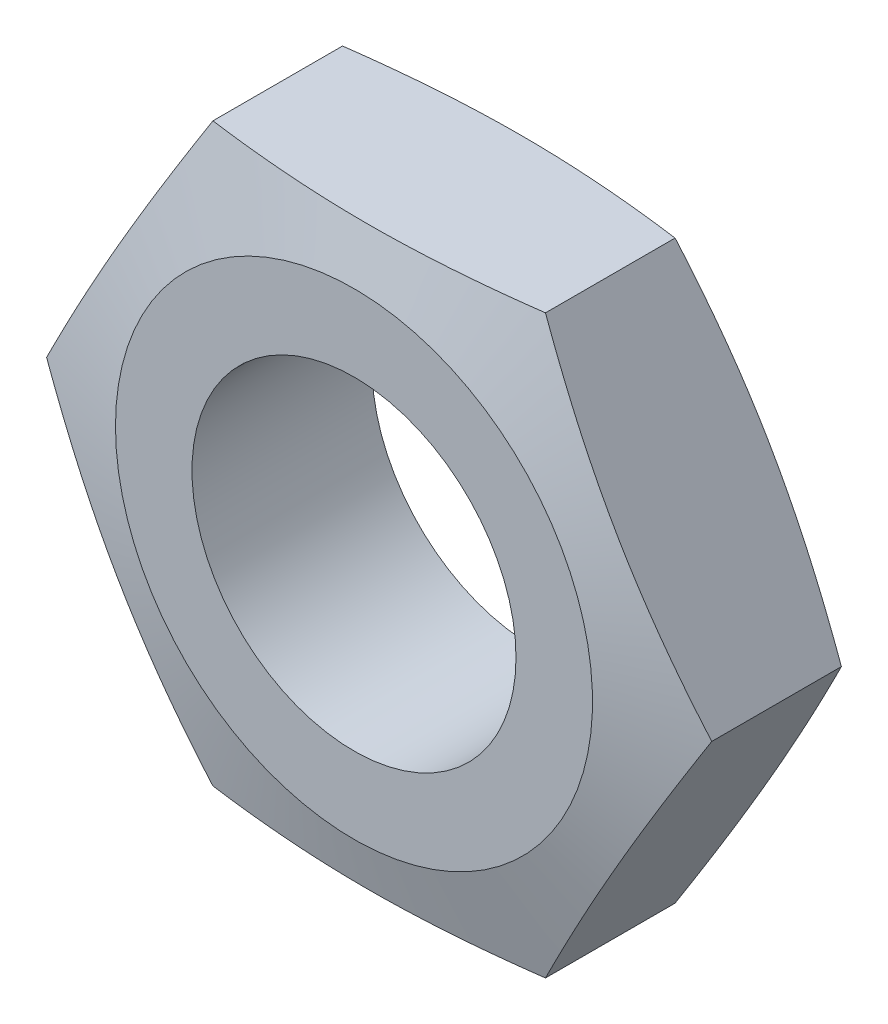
ISO-10303-21;
HEADER;
FILE_DESCRIPTION(('STEP AP214'),'2;1');
FILE_NAME('part.step','',(''),(''),'','','');
FILE_SCHEMA(('AUTOMOTIVE_DESIGN { 1 0 10303 214 1 1 1 1 }'));
ENDSEC;
DATA;
#1=APPLICATION_CONTEXT('core data for automotive mechanical design processes');
#2=APPLICATION_PROTOCOL_DEFINITION('international standard','automotive_design',2000,#1);
#3=PRODUCT_CONTEXT('',#1,'mechanical');
#4=PRODUCT('Part','Part','',(#3));
#5=PRODUCT_RELATED_PRODUCT_CATEGORY('part','',(#4));
#6=PRODUCT_DEFINITION_FORMATION('','',#4);
#7=PRODUCT_DEFINITION_CONTEXT('part definition',#1,'design');
#8=PRODUCT_DEFINITION('design','',#6,#7);
#9=PRODUCT_DEFINITION_SHAPE('','',#8);
#10=(LENGTH_UNIT() NAMED_UNIT(*) SI_UNIT(.MILLI.,.METRE.));
#11=(NAMED_UNIT(*) PLANE_ANGLE_UNIT() SI_UNIT($,.RADIAN.));
#12=(NAMED_UNIT(*) SI_UNIT($,.STERADIAN.) SOLID_ANGLE_UNIT());
#13=UNCERTAINTY_MEASURE_WITH_UNIT(LENGTH_MEASURE(1.E-05),#10,'distance_accuracy_value','');
#14=(GEOMETRIC_REPRESENTATION_CONTEXT(3) GLOBAL_UNCERTAINTY_ASSIGNED_CONTEXT((#13)) GLOBAL_UNIT_ASSIGNED_CONTEXT((#10,
#11,#12)) REPRESENTATION_CONTEXT('',''));
#15=CARTESIAN_POINT('',(0.,0.,0.));
#16=DIRECTION('',(0.,0.,1.));
#17=DIRECTION('',(1.,0.,0.));
#18=AXIS2_PLACEMENT_3D('',#15,#16,#17);
#19=CARTESIAN_POINT('',(-9.23760430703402,0.,-2.5));
#20=DIRECTION('',(0.866025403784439,-0.5,0.));
#21=DIRECTION('',(0.5,0.866025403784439,0.));
#22=AXIS2_PLACEMENT_3D('',#19,#20,#21);
#23=PLANE('',#22);
#24=CARTESIAN_POINT('',(-4.61868668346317,8.0002,1.79996905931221));
#25=CARTESIAN_POINT('',(-4.81050350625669,7.66796351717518,1.85138759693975));
#26=CARTESIAN_POINT('',(-5.0026681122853,7.33512465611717,1.89806712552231));
#27=CARTESIAN_POINT('',(-5.38767596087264,6.66827150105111,1.98007865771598));
#28=CARTESIAN_POINT('',(-5.58051944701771,6.33425678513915,2.01540605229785));
#29=CARTESIAN_POINT('',(-5.96571585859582,5.66707702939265,2.07265094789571));
#30=CARTESIAN_POINT('',(-6.15806617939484,5.33391650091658,2.09463671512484));
#31=CARTESIAN_POINT('',(-6.54301211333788,4.66717058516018,2.12411737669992));
#32=CARTESIAN_POINT('',(-6.7356076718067,4.33358529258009,2.13161507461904));
#33=CARTESIAN_POINT('',(-7.12079878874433,3.66641470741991,2.13161507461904));
#34=CARTESIAN_POINT('',(-7.31339434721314,3.33282941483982,2.12411737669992));
#35=CARTESIAN_POINT('',(-7.69834028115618,2.66608349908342,2.09463671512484));
#36=CARTESIAN_POINT('',(-7.8906906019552,2.33292297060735,2.07265094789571));
#37=CARTESIAN_POINT('',(-8.27588701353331,1.66574321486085,2.01540605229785));
#38=CARTESIAN_POINT('',(-8.46873049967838,1.33172849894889,1.98007865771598));
#39=CARTESIAN_POINT('',(-8.85373834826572,0.664875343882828,1.89806712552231));
#40=CARTESIAN_POINT('',(-9.04590295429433,0.332036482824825,1.85138759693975));
#41=CARTESIAN_POINT('',(-9.23771977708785,-0.000199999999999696,1.79996905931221));
#42=B_SPLINE_CURVE_WITH_KNOTS('',3,(#24,#25,#26,#27,#28,#29,#30,#31,#32,#33,#34,#35,#36,#37,#38,
#39,#40,#41),.UNSPECIFIED.,.F.,.F.,(4,2,2,2,2,2,2,2,4),(0.,1.1612532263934,2.32297733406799,
3.47870589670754,4.63421079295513,5.78971568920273,6.94544425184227,8.10716835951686,
9.26842158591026),.UNSPECIFIED.);
#43=CARTESIAN_POINT('',(-4.61880215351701,8.,1.8));
#44=VERTEX_POINT('',#43);
#45=CARTESIAN_POINT('',(-9.23760430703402,0.,1.8));
#46=VERTEX_POINT('',#45);
#47=EDGE_CURVE('E43',#44,#46,#42,.T.);
#48=ORIENTED_EDGE('',*,*,#47,.F.);
#49=DIRECTION('',(0.,0.,1.));
#50=VECTOR('',#49,1.);
#51=CARTESIAN_POINT('',(-4.61880215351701,8.,-2.5));
#52=LINE('',#51,#50);
#53=CARTESIAN_POINT('',(-4.61880215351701,8.,-1.8));
#54=VERTEX_POINT('',#53);
#55=EDGE_CURVE('E11',#54,#44,#52,.T.);
#56=ORIENTED_EDGE('',*,*,#55,.F.);
#57=CARTESIAN_POINT('',(-9.23771977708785,-0.000199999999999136,-1.79996905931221));
#58=CARTESIAN_POINT('',(-9.04590295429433,0.332036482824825,-1.85138759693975));
#59=CARTESIAN_POINT('',(-8.85373834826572,0.664875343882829,-1.89806712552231));
#60=CARTESIAN_POINT('',(-8.46873049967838,1.33172849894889,-1.98007865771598));
#61=CARTESIAN_POINT('',(-8.27588701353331,1.66574321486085,-2.01540605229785));
#62=CARTESIAN_POINT('',(-7.8906906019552,2.33292297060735,-2.07265094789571));
#63=CARTESIAN_POINT('',(-7.69834028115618,2.66608349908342,-2.09463671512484));
#64=CARTESIAN_POINT('',(-7.31339434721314,3.33282941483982,-2.12411737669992));
#65=CARTESIAN_POINT('',(-7.12079878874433,3.66641470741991,-2.13161507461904));
#66=CARTESIAN_POINT('',(-6.7356076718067,4.33358529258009,-2.13161507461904));
#67=CARTESIAN_POINT('',(-6.54301211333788,4.66717058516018,-2.12411737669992));
#68=CARTESIAN_POINT('',(-6.15806617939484,5.33391650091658,-2.09463671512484));
#69=CARTESIAN_POINT('',(-5.96571585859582,5.66707702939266,-2.07265094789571));
#70=CARTESIAN_POINT('',(-5.58051944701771,6.33425678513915,-2.01540605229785));
#71=CARTESIAN_POINT('',(-5.38767596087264,6.66827150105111,-1.98007865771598));
#72=CARTESIAN_POINT('',(-5.0026681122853,7.33512465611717,-1.89806712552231));
#73=CARTESIAN_POINT('',(-4.81050350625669,7.66796351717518,-1.85138759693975));
#74=CARTESIAN_POINT('',(-4.61868668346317,8.0002,-1.79996905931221));
#75=B_SPLINE_CURVE_WITH_KNOTS('',3,(#57,#58,#59,#60,#61,#62,#63,#64,#65,#66,#67,#68,#69,#70,#71,
#72,#73,#74),.UNSPECIFIED.,.F.,.F.,(4,2,2,2,2,2,2,2,4),(0.,1.1612532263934,2.32297733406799,
3.47870589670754,4.63421079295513,5.78971568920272,6.94544425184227,8.10716835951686,
9.26842158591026),.UNSPECIFIED.);
#76=CARTESIAN_POINT('',(-9.23760430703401,0.,-1.8));
#77=VERTEX_POINT('',#76);
#78=EDGE_CURVE('E99',#77,#54,#75,.T.);
#79=ORIENTED_EDGE('',*,*,#78,.F.);
#80=DIRECTION('',(0.,0.,1.));
#81=VECTOR('',#80,1.);
#82=CARTESIAN_POINT('',(-9.23760430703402,0.,-2.5));
#83=LINE('',#82,#81);
#84=EDGE_CURVE('E92',#77,#46,#83,.T.);
#85=ORIENTED_EDGE('',*,*,#84,.T.);
#86=EDGE_LOOP('',(#48,#56,#79,#85));
#87=FACE_BOUND('',#86,.T.);
#88=ADVANCED_FACE('F28',(#87),#23,.F.);
#89=CARTESIAN_POINT('',(-4.61880215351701,8.,-2.5));
#90=DIRECTION('',(0.,-1.,0.));
#91=DIRECTION('',(1.,0.,0.));
#92=AXIS2_PLACEMENT_3D('',#89,#90,#91);
#93=PLANE('',#92);
#94=CARTESIAN_POINT('',(-12.1849225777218,8.,0.369465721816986));
#95=CARTESIAN_POINT('',(-11.8223547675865,8.,0.450654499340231));
#96=CARTESIAN_POINT('',(-11.4595592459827,8.,0.53084468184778));
#97=CARTESIAN_POINT('',(-10.7334010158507,8.,0.688688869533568));
#98=CARTESIAN_POINT('',(-10.3700382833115,8.,0.766342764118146));
#99=CARTESIAN_POINT('',(-9.64230414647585,8.,0.918643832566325));
#100=CARTESIAN_POINT('',(-9.27793209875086,8.,0.993287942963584));
#101=CARTESIAN_POINT('',(-8.54842712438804,8.,1.13875840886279));
#102=CARTESIAN_POINT('',(-8.1832942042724,8.,1.20958479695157));
#103=CARTESIAN_POINT('',(-7.45507803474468,8.,1.34595992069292));
#104=CARTESIAN_POINT('',(-7.09200190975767,8.,1.41154651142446));
#105=CARTESIAN_POINT('',(-6.36485746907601,8.,1.53695681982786));
#106=CARTESIAN_POINT('',(-6.00078917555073,8.,1.59678066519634));
#107=CARTESIAN_POINT('',(-5.27159334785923,8.,1.70931153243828));
#108=CARTESIAN_POINT('',(-4.90646595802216,8.,1.76201948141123));
#109=CARTESIAN_POINT('',(-4.17505043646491,8.,1.85875926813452));
#110=CARTESIAN_POINT('',(-3.80876230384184,8.,1.90279109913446));
#111=CARTESIAN_POINT('',(-3.07090406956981,8.,1.98092498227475));
#112=CARTESIAN_POINT('',(-2.69932123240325,8.,2.01490855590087));
#113=CARTESIAN_POINT('',(-1.95522869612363,8.,2.07059677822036));
#114=CARTESIAN_POINT('',(-1.58271901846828,8.,2.0923017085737));
#115=CARTESIAN_POINT('',(-0.83731293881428,8.,2.12216640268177));
#116=CARTESIAN_POINT('',(-0.464416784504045,8.,2.13033222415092));
#117=CARTESIAN_POINT('',(0.28141928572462,8.,2.13261752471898));
#118=CARTESIAN_POINT('',(0.654359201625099,8.,2.12673700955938));
#119=CARTESIAN_POINT('',(1.40113374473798,8.,2.10125984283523));
#120=CARTESIAN_POINT('',(1.77496661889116,8.,2.08161283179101));
#121=CARTESIAN_POINT('',(2.5217487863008,8.,2.02972025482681));
#122=CARTESIAN_POINT('',(2.89469805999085,8.,1.99747441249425));
#123=CARTESIAN_POINT('',(3.63971166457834,8.,1.92200466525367));
#124=CARTESIAN_POINT('',(4.01177526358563,8.,1.87877364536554));
#125=CARTESIAN_POINT('',(4.75470621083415,8.,1.78312225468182));
#126=CARTESIAN_POINT('',(5.12557355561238,8.,1.73070185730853));
#127=CARTESIAN_POINT('',(5.84376182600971,8.,1.62173599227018));
#128=CARTESIAN_POINT('',(6.19115036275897,8.,1.56563170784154));
#129=CARTESIAN_POINT('',(6.8850090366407,8.,1.4479803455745));
#130=CARTESIAN_POINT('',(7.23147914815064,8.,1.38643311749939));
#131=CARTESIAN_POINT('',(7.92362933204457,8.,1.2588962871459));
#132=CARTESIAN_POINT('',(8.26930932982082,8.,1.19290628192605));
#133=CARTESIAN_POINT('',(8.95995874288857,8.,1.05729845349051));
#134=CARTESIAN_POINT('',(9.30492814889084,8.,0.987680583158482));
#135=CARTESIAN_POINT('',(10.3390795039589,8.00000000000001,0.774374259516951));
#136=CARTESIAN_POINT('',(11.0273481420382,8.,0.62626258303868));
#137=CARTESIAN_POINT('',(12.402058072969,8.,0.322057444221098));
#138=CARTESIAN_POINT('',(13.0884994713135,8.,0.16596445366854));
#139=CARTESIAN_POINT('',(14.4531986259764,8.,-0.150244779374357));
#140=CARTESIAN_POINT('',(15.1314694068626,8.,-0.310304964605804));
#141=CARTESIAN_POINT('',(16.4870690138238,8.,-0.634408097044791));
#142=CARTESIAN_POINT('',(17.1643978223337,8.,-0.79845111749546));
#143=CARTESIAN_POINT('',(18.5174972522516,8.,-1.12927321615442));
#144=CARTESIAN_POINT('',(19.1932687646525,8.00000000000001,-1.29604865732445));
#145=CARTESIAN_POINT('',(20.5442263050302,8.00000000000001,-1.63186115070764));
#146=CARTESIAN_POINT('',(21.2194123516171,8.00000000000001,-1.80089812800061));
#147=CARTESIAN_POINT('',(21.8943945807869,8.00000000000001,-1.97073542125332));
#148=B_SPLINE_CURVE_WITH_KNOTS('',3,(#94,#95,#96,#97,#98,#99,#100,#101,#102,#103,#104,#105,#106,
#107,#108,#109,#110,#111,#112,#113,#114,#115,#116,#117,#118,#119,#120,#121,#122,#123,#124,#125,
#126,#127,#128,#129,#130,#131,#132,#133,#134,#135,#136,#137,#138,#139,#140,#141,#142,#143,#144,
#145,#146,#147),.UNSPECIFIED.,.F.,.F.,(4,2,2,2,2,2,2,2,2,2,2,2,2,2,2,2,2,2,2,2,2,2,2,2,2,2,4),
(0.,1.11464502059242,2.22933858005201,3.3451394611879,4.46093081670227,5.56775091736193,
6.67454648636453,7.78119771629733,8.88784980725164,10.0070728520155,11.1262702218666,
12.2449667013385,13.3636627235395,14.4864725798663,15.6093070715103,16.7328706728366,
17.8564375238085,18.9120559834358,19.9677035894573,21.0234470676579,22.0792042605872,
24.191196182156,26.3030634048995,28.3937483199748,30.4844717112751,32.5726078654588,
34.6606750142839),.UNSPECIFIED.);
#149=CARTESIAN_POINT('',(4.61880215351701,8.,1.8));
#150=VERTEX_POINT('',#149);
#151=EDGE_CURVE('E79',#150,#44,#148,.F.);
#152=ORIENTED_EDGE('',*,*,#151,.F.);
#153=DIRECTION('',(0.,0.,1.));
#154=VECTOR('',#153,1.);
#155=CARTESIAN_POINT('',(4.61880215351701,8.,-2.5));
#156=LINE('',#155,#154);
#157=CARTESIAN_POINT('',(4.61880215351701,8.,-1.8));
#158=VERTEX_POINT('',#157);
#159=EDGE_CURVE('E36',#158,#150,#156,.T.);
#160=ORIENTED_EDGE('',*,*,#159,.F.);
#161=CARTESIAN_POINT('',(-12.1849225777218,8.,-0.369465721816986));
#162=CARTESIAN_POINT('',(-11.8223547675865,8.,-0.450654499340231));
#163=CARTESIAN_POINT('',(-11.4595592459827,8.,-0.53084468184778));
#164=CARTESIAN_POINT('',(-10.7334010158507,8.,-0.688688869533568));
#165=CARTESIAN_POINT('',(-10.3700382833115,8.,-0.766342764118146));
#166=CARTESIAN_POINT('',(-9.64230414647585,8.,-0.918643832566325));
#167=CARTESIAN_POINT('',(-9.27793209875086,8.,-0.993287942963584));
#168=CARTESIAN_POINT('',(-8.54842712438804,8.,-1.13875840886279));
#169=CARTESIAN_POINT('',(-8.1832942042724,8.,-1.20958479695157));
#170=CARTESIAN_POINT('',(-7.45507803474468,8.,-1.34595992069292));
#171=CARTESIAN_POINT('',(-7.09200190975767,8.,-1.41154651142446));
#172=CARTESIAN_POINT('',(-6.36485746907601,8.,-1.53695681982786));
#173=CARTESIAN_POINT('',(-6.00078917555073,8.,-1.59678066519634));
#174=CARTESIAN_POINT('',(-5.27159334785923,8.,-1.70931153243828));
#175=CARTESIAN_POINT('',(-4.90646595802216,8.,-1.76201948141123));
#176=CARTESIAN_POINT('',(-4.17505043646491,8.,-1.85875926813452));
#177=CARTESIAN_POINT('',(-3.80876230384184,8.,-1.90279109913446));
#178=CARTESIAN_POINT('',(-3.07090406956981,8.,-1.98092498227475));
#179=CARTESIAN_POINT('',(-2.69932123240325,8.,-2.01490855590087));
#180=CARTESIAN_POINT('',(-1.95522869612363,8.,-2.07059677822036));
#181=CARTESIAN_POINT('',(-1.58271901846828,8.,-2.0923017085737));
#182=CARTESIAN_POINT('',(-0.83731293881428,8.,-2.12216640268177));
#183=CARTESIAN_POINT('',(-0.464416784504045,8.,-2.13033222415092));
#184=CARTESIAN_POINT('',(0.28141928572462,8.,-2.13261752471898));
#185=CARTESIAN_POINT('',(0.654359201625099,8.,-2.12673700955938));
#186=CARTESIAN_POINT('',(1.40113374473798,8.,-2.10125984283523));
#187=CARTESIAN_POINT('',(1.77496661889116,8.,-2.08161283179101));
#188=CARTESIAN_POINT('',(2.5217487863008,8.,-2.02972025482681));
#189=CARTESIAN_POINT('',(2.89469805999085,8.,-1.99747441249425));
#190=CARTESIAN_POINT('',(3.63971166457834,8.,-1.92200466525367));
#191=CARTESIAN_POINT('',(4.01177526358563,8.,-1.87877364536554));
#192=CARTESIAN_POINT('',(4.75470621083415,8.,-1.78312225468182));
#193=CARTESIAN_POINT('',(5.12557355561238,8.,-1.73070185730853));
#194=CARTESIAN_POINT('',(5.84376182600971,8.,-1.62173599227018));
#195=CARTESIAN_POINT('',(6.19115036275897,8.,-1.56563170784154));
#196=CARTESIAN_POINT('',(6.8850090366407,8.,-1.4479803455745));
#197=CARTESIAN_POINT('',(7.23147914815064,8.,-1.38643311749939));
#198=CARTESIAN_POINT('',(7.92362933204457,8.,-1.2588962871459));
#199=CARTESIAN_POINT('',(8.26930932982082,8.,-1.19290628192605));
#200=CARTESIAN_POINT('',(8.95995874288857,8.,-1.05729845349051));
#201=CARTESIAN_POINT('',(9.30492814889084,8.,-0.987680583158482));
#202=CARTESIAN_POINT('',(10.3390795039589,8.00000000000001,-0.774374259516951));
#203=CARTESIAN_POINT('',(11.0273481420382,8.,-0.62626258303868));
#204=CARTESIAN_POINT('',(12.402058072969,8.,-0.322057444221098));
#205=CARTESIAN_POINT('',(13.0884994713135,8.,-0.16596445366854));
#206=CARTESIAN_POINT('',(14.4531986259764,8.,0.150244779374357));
#207=CARTESIAN_POINT('',(15.1314694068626,8.,0.310304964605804));
#208=CARTESIAN_POINT('',(16.4870690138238,8.,0.634408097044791));
#209=CARTESIAN_POINT('',(17.1643978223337,8.,0.79845111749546));
#210=CARTESIAN_POINT('',(18.5174972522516,8.,1.12927321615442));
#211=CARTESIAN_POINT('',(19.1932687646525,8.00000000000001,1.29604865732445));
#212=CARTESIAN_POINT('',(20.5442263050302,8.00000000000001,1.63186115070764));
#213=CARTESIAN_POINT('',(21.2194123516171,8.00000000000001,1.80089812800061));
#214=CARTESIAN_POINT('',(21.8943945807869,8.00000000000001,1.97073542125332));
#215=B_SPLINE_CURVE_WITH_KNOTS('',3,(#161,#162,#163,#164,#165,#166,#167,#168,#169,#170,#171,
#172,#173,#174,#175,#176,#177,#178,#179,#180,#181,#182,#183,#184,#185,#186,#187,#188,#189,#190,
#191,#192,#193,#194,#195,#196,#197,#198,#199,#200,#201,#202,#203,#204,#205,#206,#207,#208,#209,
#210,#211,#212,#213,#214),.UNSPECIFIED.,.F.,.F.,(4,2,2,2,2,2,2,2,2,2,2,2,2,2,2,2,2,2,2,2,2,2,2,
2,2,2,4),(0.,1.11464502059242,2.22933858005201,3.3451394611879,4.46093081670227,
5.56775091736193,6.67454648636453,7.78119771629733,8.88784980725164,10.0070728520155,
11.1262702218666,12.2449667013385,13.3636627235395,14.4864725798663,15.6093070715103,
16.7328706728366,17.8564375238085,18.9120559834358,19.9677035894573,21.0234470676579,
22.0792042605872,24.191196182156,26.3030634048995,28.3937483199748,30.4844717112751,
32.5726078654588,34.6606750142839),.UNSPECIFIED.);
#216=EDGE_CURVE('E97',#54,#158,#215,.T.);
#217=ORIENTED_EDGE('',*,*,#216,.F.);
#218=ORIENTED_EDGE('',*,*,#55,.T.);
#219=EDGE_LOOP('',(#152,#160,#217,#218));
#220=FACE_BOUND('',#219,.T.);
#221=ADVANCED_FACE('F96',(#220),#93,.F.);
#222=CARTESIAN_POINT('',(4.61880215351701,8.,-2.5));
#223=DIRECTION('',(-0.866025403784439,-0.5,0.));
#224=DIRECTION('',(0.5,-0.866025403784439,0.));
#225=AXIS2_PLACEMENT_3D('',#222,#223,#224);
#226=PLANE('',#225);
#227=CARTESIAN_POINT('',(9.23771977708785,-0.000199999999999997,1.7999690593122));
#228=CARTESIAN_POINT('',(9.04590295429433,0.332036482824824,1.85138759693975));
#229=CARTESIAN_POINT('',(8.85373834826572,0.664875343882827,1.89806712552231));
#230=CARTESIAN_POINT('',(8.46873049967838,1.33172849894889,1.98007865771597));
#231=CARTESIAN_POINT('',(8.27588701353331,1.66574321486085,2.01540605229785));
#232=CARTESIAN_POINT('',(7.8906906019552,2.33292297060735,2.07265094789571));
#233=CARTESIAN_POINT('',(7.69834028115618,2.66608349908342,2.09463671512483));
#234=CARTESIAN_POINT('',(7.31339434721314,3.33282941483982,2.12411737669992));
#235=CARTESIAN_POINT('',(7.12079878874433,3.66641470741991,2.13161507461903));
#236=CARTESIAN_POINT('',(6.7356076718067,4.33358529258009,2.13161507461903));
#237=CARTESIAN_POINT('',(6.54301211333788,4.66717058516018,2.12411737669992));
#238=CARTESIAN_POINT('',(6.15806617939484,5.33391650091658,2.09463671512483));
#239=CARTESIAN_POINT('',(5.96571585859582,5.66707702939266,2.07265094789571));
#240=CARTESIAN_POINT('',(5.58051944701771,6.33425678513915,2.01540605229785));
#241=CARTESIAN_POINT('',(5.38767596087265,6.66827150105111,1.98007865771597));
#242=CARTESIAN_POINT('',(5.0026681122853,7.33512465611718,1.89806712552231));
#243=CARTESIAN_POINT('',(4.81050350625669,7.66796351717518,1.85138759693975));
#244=CARTESIAN_POINT('',(4.61868668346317,8.0002,1.7999690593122));
#245=B_SPLINE_CURVE_WITH_KNOTS('',3,(#227,#228,#229,#230,#231,#232,#233,#234,#235,#236,#237,
#238,#239,#240,#241,#242,#243,#244),.UNSPECIFIED.,.F.,.F.,(4,2,2,2,2,2,2,2,4),(0.,
1.1612532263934,2.322977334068,3.47870589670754,4.63421079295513,5.78971568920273,
6.94544425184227,8.10716835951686,9.26842158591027),.UNSPECIFIED.);
#246=CARTESIAN_POINT('',(9.23760430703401,0.,1.8));
#247=VERTEX_POINT('',#246);
#248=EDGE_CURVE('E82',#247,#150,#245,.T.);
#249=ORIENTED_EDGE('',*,*,#248,.F.);
#250=DIRECTION('',(0.,0.,1.));
#251=VECTOR('',#250,1.);
#252=CARTESIAN_POINT('',(9.23760430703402,0.,-2.5));
#253=LINE('',#252,#251);
#254=CARTESIAN_POINT('',(9.23760430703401,0.,-1.8));
#255=VERTEX_POINT('',#254);
#256=EDGE_CURVE('E198',#255,#247,#253,.T.);
#257=ORIENTED_EDGE('',*,*,#256,.F.);
#258=CARTESIAN_POINT('',(4.61868668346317,8.0002,-1.7999690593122));
#259=CARTESIAN_POINT('',(4.81050350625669,7.66796351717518,-1.85138759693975));
#260=CARTESIAN_POINT('',(5.0026681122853,7.33512465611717,-1.89806712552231));
#261=CARTESIAN_POINT('',(5.38767596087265,6.66827150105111,-1.98007865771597));
#262=CARTESIAN_POINT('',(5.58051944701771,6.33425678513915,-2.01540605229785));
#263=CARTESIAN_POINT('',(5.96571585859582,5.66707702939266,-2.07265094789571));
#264=CARTESIAN_POINT('',(6.15806617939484,5.33391650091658,-2.09463671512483));
#265=CARTESIAN_POINT('',(6.54301211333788,4.66717058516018,-2.12411737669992));
#266=CARTESIAN_POINT('',(6.7356076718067,4.33358529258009,-2.13161507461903));
#267=CARTESIAN_POINT('',(7.12079878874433,3.66641470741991,-2.13161507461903));
#268=CARTESIAN_POINT('',(7.31339434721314,3.33282941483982,-2.12411737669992));
#269=CARTESIAN_POINT('',(7.69834028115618,2.66608349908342,-2.09463671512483));
#270=CARTESIAN_POINT('',(7.8906906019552,2.33292297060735,-2.07265094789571));
#271=CARTESIAN_POINT('',(8.27588701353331,1.66574321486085,-2.01540605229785));
#272=CARTESIAN_POINT('',(8.46873049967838,1.33172849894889,-1.98007865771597));
#273=CARTESIAN_POINT('',(8.85373834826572,0.664875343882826,-1.89806712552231));
#274=CARTESIAN_POINT('',(9.04590295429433,0.332036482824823,-1.85138759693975));
#275=CARTESIAN_POINT('',(9.23771977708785,-0.000200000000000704,-1.7999690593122));
#276=B_SPLINE_CURVE_WITH_KNOTS('',3,(#258,#259,#260,#261,#262,#263,#264,#265,#266,#267,#268,
#269,#270,#271,#272,#273,#274,#275),.UNSPECIFIED.,.F.,.F.,(4,2,2,2,2,2,2,2,4),(0.,
1.1612532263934,2.322977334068,3.47870589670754,4.63421079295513,5.78971568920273,
6.94544425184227,8.10716835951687,9.26842158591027),.UNSPECIFIED.);
#277=EDGE_CURVE('E100',#158,#255,#276,.T.);
#278=ORIENTED_EDGE('',*,*,#277,.F.);
#279=ORIENTED_EDGE('',*,*,#159,.T.);
#280=EDGE_LOOP('',(#249,#257,#278,#279));
#281=FACE_BOUND('',#280,.T.);
#282=ADVANCED_FACE('F154',(#281),#226,.F.);
#283=CARTESIAN_POINT('',(9.23760430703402,0.,-2.5));
#284=DIRECTION('',(-0.866025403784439,0.5,0.));
#285=DIRECTION('',(-0.5,-0.866025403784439,0.));
#286=AXIS2_PLACEMENT_3D('',#283,#284,#285);
#287=PLANE('',#286);
#288=CARTESIAN_POINT('',(4.61868668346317,-8.0002,1.7999690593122));
#289=CARTESIAN_POINT('',(4.81050350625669,-7.66796351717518,1.85138759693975));
#290=CARTESIAN_POINT('',(5.0026681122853,-7.33512465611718,1.89806712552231));
#291=CARTESIAN_POINT('',(5.38767596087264,-6.66827150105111,1.98007865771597));
#292=CARTESIAN_POINT('',(5.58051944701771,-6.33425678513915,2.01540605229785));
#293=CARTESIAN_POINT('',(5.96571585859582,-5.66707702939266,2.07265094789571));
#294=CARTESIAN_POINT('',(6.15806617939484,-5.33391650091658,2.09463671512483));
#295=CARTESIAN_POINT('',(6.54301211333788,-4.66717058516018,2.12411737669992));
#296=CARTESIAN_POINT('',(6.73560767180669,-4.33358529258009,2.13161507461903));
#297=CARTESIAN_POINT('',(7.12079878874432,-3.66641470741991,2.13161507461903));
#298=CARTESIAN_POINT('',(7.31339434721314,-3.33282941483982,2.12411737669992));
#299=CARTESIAN_POINT('',(7.69834028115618,-2.66608349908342,2.09463671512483));
#300=CARTESIAN_POINT('',(7.8906906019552,-2.33292297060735,2.07265094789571));
#301=CARTESIAN_POINT('',(8.27588701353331,-1.66574321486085,2.01540605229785));
#302=CARTESIAN_POINT('',(8.46873049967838,-1.33172849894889,1.98007865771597));
#303=CARTESIAN_POINT('',(8.85373834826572,-0.664875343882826,1.89806712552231));
#304=CARTESIAN_POINT('',(9.04590295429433,-0.332036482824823,1.85138759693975));
#305=CARTESIAN_POINT('',(9.23771977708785,0.000200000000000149,1.7999690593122));
#306=B_SPLINE_CURVE_WITH_KNOTS('',3,(#288,#289,#290,#291,#292,#293,#294,#295,#296,#297,#298,
#299,#300,#301,#302,#303,#304,#305),.UNSPECIFIED.,.F.,.F.,(4,2,2,2,2,2,2,2,4),(0.,
1.1612532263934,2.322977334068,3.47870589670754,4.63421079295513,5.78971568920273,
6.94544425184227,8.10716835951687,9.26842158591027),.UNSPECIFIED.);
#307=CARTESIAN_POINT('',(4.61880215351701,-8.,1.8));
#308=VERTEX_POINT('',#307);
#309=EDGE_CURVE('E160',#308,#247,#306,.T.);
#310=ORIENTED_EDGE('',*,*,#309,.F.);
#311=DIRECTION('',(0.,0.,1.));
#312=VECTOR('',#311,1.);
#313=CARTESIAN_POINT('',(4.61880215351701,-8.,-2.5));
#314=LINE('',#313,#312);
#315=CARTESIAN_POINT('',(4.61880215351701,-8.,-1.8));
#316=VERTEX_POINT('',#315);
#317=EDGE_CURVE('E191',#316,#308,#314,.T.);
#318=ORIENTED_EDGE('',*,*,#317,.F.);
#319=CARTESIAN_POINT('',(9.23771977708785,0.000200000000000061,-1.7999690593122));
#320=CARTESIAN_POINT('',(9.04590295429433,-0.332036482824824,-1.85138759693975));
#321=CARTESIAN_POINT('',(8.85373834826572,-0.664875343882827,-1.89806712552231));
#322=CARTESIAN_POINT('',(8.46873049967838,-1.33172849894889,-1.98007865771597));
#323=CARTESIAN_POINT('',(8.27588701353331,-1.66574321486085,-2.01540605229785));
#324=CARTESIAN_POINT('',(7.8906906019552,-2.33292297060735,-2.07265094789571));
#325=CARTESIAN_POINT('',(7.69834028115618,-2.66608349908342,-2.09463671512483));
#326=CARTESIAN_POINT('',(7.31339434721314,-3.33282941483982,-2.12411737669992));
#327=CARTESIAN_POINT('',(7.12079878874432,-3.66641470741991,-2.13161507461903));
#328=CARTESIAN_POINT('',(6.73560767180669,-4.33358529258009,-2.13161507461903));
#329=CARTESIAN_POINT('',(6.54301211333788,-4.66717058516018,-2.12411737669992));
#330=CARTESIAN_POINT('',(6.15806617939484,-5.33391650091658,-2.09463671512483));
#331=CARTESIAN_POINT('',(5.96571585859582,-5.66707702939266,-2.07265094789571));
#332=CARTESIAN_POINT('',(5.58051944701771,-6.33425678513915,-2.01540605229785));
#333=CARTESIAN_POINT('',(5.38767596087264,-6.66827150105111,-1.98007865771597));
#334=CARTESIAN_POINT('',(5.0026681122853,-7.33512465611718,-1.89806712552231));
#335=CARTESIAN_POINT('',(4.81050350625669,-7.66796351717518,-1.85138759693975));
#336=CARTESIAN_POINT('',(4.61868668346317,-8.0002,-1.7999690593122));
#337=B_SPLINE_CURVE_WITH_KNOTS('',3,(#319,#320,#321,#322,#323,#324,#325,#326,#327,#328,#329,
#330,#331,#332,#333,#334,#335,#336),.UNSPECIFIED.,.F.,.F.,(4,2,2,2,2,2,2,2,4),(0.,
1.1612532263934,2.322977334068,3.47870589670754,4.63421079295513,5.78971568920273,
6.94544425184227,8.10716835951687,9.26842158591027),.UNSPECIFIED.);
#338=EDGE_CURVE('E104',#255,#316,#337,.T.);
#339=ORIENTED_EDGE('',*,*,#338,.F.);
#340=ORIENTED_EDGE('',*,*,#256,.T.);
#341=EDGE_LOOP('',(#310,#318,#339,#340));
#342=FACE_BOUND('',#341,.T.);
#343=ADVANCED_FACE('F150',(#342),#287,.F.);
#344=CARTESIAN_POINT('',(4.61880215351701,-8.,-2.5));
#345=DIRECTION('',(0.,1.,0.));
#346=DIRECTION('',(-1.,0.,0.));
#347=AXIS2_PLACEMENT_3D('',#344,#345,#346);
#348=PLANE('',#347);
#349=CARTESIAN_POINT('',(-12.1849225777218,-8.,0.369465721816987));
#350=CARTESIAN_POINT('',(-11.8223547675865,-8.,0.450654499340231));
#351=CARTESIAN_POINT('',(-11.4595592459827,-8.,0.530844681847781));
#352=CARTESIAN_POINT('',(-10.7334010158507,-8.,0.688688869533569));
#353=CARTESIAN_POINT('',(-10.3700382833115,-8.,0.766342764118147));
#354=CARTESIAN_POINT('',(-9.64230414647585,-8.,0.918643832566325));
#355=CARTESIAN_POINT('',(-9.27793209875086,-8.,0.993287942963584));
#356=CARTESIAN_POINT('',(-8.54842712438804,-8.,1.13875840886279));
#357=CARTESIAN_POINT('',(-8.1832942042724,-8.,1.20958479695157));
#358=CARTESIAN_POINT('',(-7.45507803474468,-8.,1.34595992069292));
#359=CARTESIAN_POINT('',(-7.09200190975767,-8.,1.41154651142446));
#360=CARTESIAN_POINT('',(-6.36485746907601,-8.,1.53695681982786));
#361=CARTESIAN_POINT('',(-6.00078917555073,-8.,1.59678066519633));
#362=CARTESIAN_POINT('',(-5.27159334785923,-8.,1.70931153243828));
#363=CARTESIAN_POINT('',(-4.90646595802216,-8.,1.76201948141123));
#364=CARTESIAN_POINT('',(-4.17505043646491,-8.,1.85875926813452));
#365=CARTESIAN_POINT('',(-3.80876230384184,-8.,1.90279109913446));
#366=CARTESIAN_POINT('',(-3.07090406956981,-8.,1.98092498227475));
#367=CARTESIAN_POINT('',(-2.69932123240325,-8.,2.01490855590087));
#368=CARTESIAN_POINT('',(-1.95522869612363,-8.,2.07059677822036));
#369=CARTESIAN_POINT('',(-1.58271901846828,-8.,2.0923017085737));
#370=CARTESIAN_POINT('',(-0.837312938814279,-8.,2.12216640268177));
#371=CARTESIAN_POINT('',(-0.464416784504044,-8.,2.13033222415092));
#372=CARTESIAN_POINT('',(0.28141928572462,-8.,2.13261752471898));
#373=CARTESIAN_POINT('',(0.654359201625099,-8.,2.12673700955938));
#374=CARTESIAN_POINT('',(1.40113374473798,-8.,2.10125984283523));
#375=CARTESIAN_POINT('',(1.77496661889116,-8.,2.08161283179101));
#376=CARTESIAN_POINT('',(2.52174878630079,-8.,2.02972025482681));
#377=CARTESIAN_POINT('',(2.89469805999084,-8.,1.99747441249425));
#378=CARTESIAN_POINT('',(3.63971166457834,-8.,1.92200466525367));
#379=CARTESIAN_POINT('',(4.01177526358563,-8.,1.87877364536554));
#380=CARTESIAN_POINT('',(4.75470621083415,-8.,1.78312225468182));
#381=CARTESIAN_POINT('',(5.12557355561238,-8.,1.73070185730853));
#382=CARTESIAN_POINT('',(5.84376182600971,-8.,1.62173599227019));
#383=CARTESIAN_POINT('',(6.19115036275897,-8.,1.56563170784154));
#384=CARTESIAN_POINT('',(6.8850090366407,-8.,1.4479803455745));
#385=CARTESIAN_POINT('',(7.23147914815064,-8.,1.38643311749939));
#386=CARTESIAN_POINT('',(7.92362933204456,-8.,1.2588962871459));
#387=CARTESIAN_POINT('',(8.26930932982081,-8.,1.19290628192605));
#388=CARTESIAN_POINT('',(8.95995874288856,-8.,1.05729845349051));
#389=CARTESIAN_POINT('',(9.30492814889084,-8.,0.987680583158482));
#390=CARTESIAN_POINT('',(10.3390795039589,-8.00000000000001,0.774374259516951));
#391=CARTESIAN_POINT('',(11.0273481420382,-8.,0.626262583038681));
#392=CARTESIAN_POINT('',(12.402058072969,-8.,0.3220574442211));
#393=CARTESIAN_POINT('',(13.0884994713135,-8.,0.165964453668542));
#394=CARTESIAN_POINT('',(14.4531986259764,-8.,-0.150244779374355));
#395=CARTESIAN_POINT('',(15.1314694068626,-8.,-0.310304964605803));
#396=CARTESIAN_POINT('',(16.4870690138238,-8.,-0.63440809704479));
#397=CARTESIAN_POINT('',(17.1643978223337,-8.,-0.798451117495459));
#398=CARTESIAN_POINT('',(18.5174972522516,-8.,-1.12927321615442));
#399=CARTESIAN_POINT('',(19.1932687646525,-8.00000000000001,-1.29604865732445));
#400=CARTESIAN_POINT('',(20.5442263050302,-8.00000000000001,-1.63186115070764));
#401=CARTESIAN_POINT('',(21.2194123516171,-8.00000000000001,-1.80089812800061));
#402=CARTESIAN_POINT('',(21.8943945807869,-8.00000000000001,-1.97073542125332));
#403=B_SPLINE_CURVE_WITH_KNOTS('',3,(#349,#350,#351,#352,#353,#354,#355,#356,#357,#358,#359,
#360,#361,#362,#363,#364,#365,#366,#367,#368,#369,#370,#371,#372,#373,#374,#375,#376,#377,#378,
#379,#380,#381,#382,#383,#384,#385,#386,#387,#388,#389,#390,#391,#392,#393,#394,#395,#396,#397,
#398,#399,#400,#401,#402),.UNSPECIFIED.,.F.,.F.,(4,2,2,2,2,2,2,2,2,2,2,2,2,2,2,2,2,2,2,2,2,2,2,
2,2,2,4),(0.,1.11464502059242,2.22933858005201,3.3451394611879,4.46093081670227,
5.56775091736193,6.67454648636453,7.78119771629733,8.88784980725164,10.0070728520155,
11.1262702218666,12.2449667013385,13.3636627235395,14.4864725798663,15.6093070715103,
16.7328706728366,17.8564375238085,18.9120559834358,19.9677035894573,21.0234470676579,
22.0792042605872,24.191196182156,26.3030634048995,28.3937483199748,30.4844717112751,
32.5726078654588,34.6606750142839),.UNSPECIFIED.);
#404=CARTESIAN_POINT('',(-4.61880215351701,-8.,1.8));
#405=VERTEX_POINT('',#404);
#406=EDGE_CURVE('E166',#405,#308,#403,.T.);
#407=ORIENTED_EDGE('',*,*,#406,.F.);
#408=DIRECTION('',(0.,0.,1.));
#409=VECTOR('',#408,1.);
#410=CARTESIAN_POINT('',(-4.61880215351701,-8.,-2.5));
#411=LINE('',#410,#409);
#412=CARTESIAN_POINT('',(-4.61880215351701,-8.,-1.8));
#413=VERTEX_POINT('',#412);
#414=EDGE_CURVE('E188',#413,#405,#411,.T.);
#415=ORIENTED_EDGE('',*,*,#414,.F.);
#416=CARTESIAN_POINT('',(-12.1849225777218,-8.,-0.369465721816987));
#417=CARTESIAN_POINT('',(-11.8223547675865,-8.,-0.450654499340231));
#418=CARTESIAN_POINT('',(-11.4595592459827,-8.,-0.530844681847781));
#419=CARTESIAN_POINT('',(-10.7334010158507,-8.,-0.688688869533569));
#420=CARTESIAN_POINT('',(-10.3700382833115,-8.,-0.766342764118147));
#421=CARTESIAN_POINT('',(-9.64230414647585,-8.,-0.918643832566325));
#422=CARTESIAN_POINT('',(-9.27793209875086,-8.,-0.993287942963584));
#423=CARTESIAN_POINT('',(-8.54842712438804,-8.,-1.13875840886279));
#424=CARTESIAN_POINT('',(-8.1832942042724,-8.,-1.20958479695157));
#425=CARTESIAN_POINT('',(-7.45507803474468,-8.,-1.34595992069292));
#426=CARTESIAN_POINT('',(-7.09200190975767,-8.,-1.41154651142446));
#427=CARTESIAN_POINT('',(-6.36485746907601,-8.,-1.53695681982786));
#428=CARTESIAN_POINT('',(-6.00078917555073,-8.,-1.59678066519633));
#429=CARTESIAN_POINT('',(-5.27159334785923,-8.,-1.70931153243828));
#430=CARTESIAN_POINT('',(-4.90646595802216,-8.,-1.76201948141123));
#431=CARTESIAN_POINT('',(-4.17505043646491,-8.,-1.85875926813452));
#432=CARTESIAN_POINT('',(-3.80876230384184,-8.,-1.90279109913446));
#433=CARTESIAN_POINT('',(-3.07090406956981,-8.,-1.98092498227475));
#434=CARTESIAN_POINT('',(-2.69932123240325,-8.,-2.01490855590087));
#435=CARTESIAN_POINT('',(-1.95522869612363,-8.,-2.07059677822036));
#436=CARTESIAN_POINT('',(-1.58271901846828,-8.,-2.0923017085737));
#437=CARTESIAN_POINT('',(-0.837312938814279,-8.,-2.12216640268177));
#438=CARTESIAN_POINT('',(-0.464416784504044,-8.,-2.13033222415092));
#439=CARTESIAN_POINT('',(0.28141928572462,-8.,-2.13261752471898));
#440=CARTESIAN_POINT('',(0.654359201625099,-8.,-2.12673700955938));
#441=CARTESIAN_POINT('',(1.40113374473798,-8.,-2.10125984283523));
#442=CARTESIAN_POINT('',(1.77496661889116,-8.,-2.08161283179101));
#443=CARTESIAN_POINT('',(2.52174878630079,-8.,-2.02972025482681));
#444=CARTESIAN_POINT('',(2.89469805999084,-8.,-1.99747441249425));
#445=CARTESIAN_POINT('',(3.63971166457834,-8.,-1.92200466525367));
#446=CARTESIAN_POINT('',(4.01177526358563,-8.,-1.87877364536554));
#447=CARTESIAN_POINT('',(4.75470621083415,-8.,-1.78312225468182));
#448=CARTESIAN_POINT('',(5.12557355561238,-8.,-1.73070185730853));
#449=CARTESIAN_POINT('',(5.84376182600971,-8.,-1.62173599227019));
#450=CARTESIAN_POINT('',(6.19115036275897,-8.,-1.56563170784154));
#451=CARTESIAN_POINT('',(6.8850090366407,-8.,-1.4479803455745));
#452=CARTESIAN_POINT('',(7.23147914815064,-8.,-1.38643311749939));
#453=CARTESIAN_POINT('',(7.92362933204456,-8.,-1.2588962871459));
#454=CARTESIAN_POINT('',(8.26930932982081,-8.,-1.19290628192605));
#455=CARTESIAN_POINT('',(8.95995874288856,-8.,-1.05729845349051));
#456=CARTESIAN_POINT('',(9.30492814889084,-8.,-0.987680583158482));
#457=CARTESIAN_POINT('',(10.3390795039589,-8.00000000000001,-0.774374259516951));
#458=CARTESIAN_POINT('',(11.0273481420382,-8.,-0.626262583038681));
#459=CARTESIAN_POINT('',(12.402058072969,-8.,-0.3220574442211));
#460=CARTESIAN_POINT('',(13.0884994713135,-8.,-0.165964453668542));
#461=CARTESIAN_POINT('',(14.4531986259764,-8.,0.150244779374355));
#462=CARTESIAN_POINT('',(15.1314694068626,-8.,0.310304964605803));
#463=CARTESIAN_POINT('',(16.4870690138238,-8.,0.63440809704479));
#464=CARTESIAN_POINT('',(17.1643978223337,-8.,0.798451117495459));
#465=CARTESIAN_POINT('',(18.5174972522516,-8.,1.12927321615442));
#466=CARTESIAN_POINT('',(19.1932687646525,-8.00000000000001,1.29604865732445));
#467=CARTESIAN_POINT('',(20.5442263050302,-8.00000000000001,1.63186115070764));
#468=CARTESIAN_POINT('',(21.2194123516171,-8.00000000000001,1.80089812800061));
#469=CARTESIAN_POINT('',(21.8943945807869,-8.00000000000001,1.97073542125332));
#470=B_SPLINE_CURVE_WITH_KNOTS('',3,(#416,#417,#418,#419,#420,#421,#422,#423,#424,#425,#426,
#427,#428,#429,#430,#431,#432,#433,#434,#435,#436,#437,#438,#439,#440,#441,#442,#443,#444,#445,
#446,#447,#448,#449,#450,#451,#452,#453,#454,#455,#456,#457,#458,#459,#460,#461,#462,#463,#464,
#465,#466,#467,#468,#469),.UNSPECIFIED.,.F.,.F.,(4,2,2,2,2,2,2,2,2,2,2,2,2,2,2,2,2,2,2,2,2,2,2,
2,2,2,4),(0.,1.11464502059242,2.22933858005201,3.3451394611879,4.46093081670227,
5.56775091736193,6.67454648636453,7.78119771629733,8.88784980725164,10.0070728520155,
11.1262702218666,12.2449667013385,13.3636627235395,14.4864725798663,15.6093070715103,
16.7328706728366,17.8564375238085,18.9120559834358,19.9677035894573,21.0234470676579,
22.0792042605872,24.191196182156,26.3030634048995,28.3937483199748,30.4844717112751,
32.5726078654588,34.6606750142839),.UNSPECIFIED.);
#471=EDGE_CURVE('E51',#316,#413,#470,.F.);
#472=ORIENTED_EDGE('',*,*,#471,.F.);
#473=ORIENTED_EDGE('',*,*,#317,.T.);
#474=EDGE_LOOP('',(#407,#415,#472,#473));
#475=FACE_BOUND('',#474,.T.);
#476=ADVANCED_FACE('F153',(#475),#348,.F.);
#477=CARTESIAN_POINT('',(-4.61880215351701,-8.,-2.5));
#478=DIRECTION('',(0.866025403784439,0.5,0.));
#479=DIRECTION('',(-0.5,0.866025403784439,0.));
#480=AXIS2_PLACEMENT_3D('',#477,#478,#479);
#481=PLANE('',#480);
#482=CARTESIAN_POINT('',(-9.23771977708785,0.000200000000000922,1.79996905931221));
#483=CARTESIAN_POINT('',(-9.04590295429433,-0.332036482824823,1.85138759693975));
#484=CARTESIAN_POINT('',(-8.85373834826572,-0.664875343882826,1.89806712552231));
#485=CARTESIAN_POINT('',(-8.46873049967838,-1.33172849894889,1.98007865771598));
#486=CARTESIAN_POINT('',(-8.27588701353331,-1.66574321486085,2.01540605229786));
#487=CARTESIAN_POINT('',(-7.8906906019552,-2.33292297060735,2.07265094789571));
#488=CARTESIAN_POINT('',(-7.69834028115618,-2.66608349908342,2.09463671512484));
#489=CARTESIAN_POINT('',(-7.31339434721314,-3.33282941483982,2.12411737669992));
#490=CARTESIAN_POINT('',(-7.12079878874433,-3.66641470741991,2.13161507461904));
#491=CARTESIAN_POINT('',(-6.7356076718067,-4.33358529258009,2.13161507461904));
#492=CARTESIAN_POINT('',(-6.54301211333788,-4.66717058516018,2.12411737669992));
#493=CARTESIAN_POINT('',(-6.15806617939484,-5.33391650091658,2.09463671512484));
#494=CARTESIAN_POINT('',(-5.96571585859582,-5.66707702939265,2.07265094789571));
#495=CARTESIAN_POINT('',(-5.58051944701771,-6.33425678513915,2.01540605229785));
#496=CARTESIAN_POINT('',(-5.38767596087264,-6.66827150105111,1.98007865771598));
#497=CARTESIAN_POINT('',(-5.0026681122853,-7.33512465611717,1.89806712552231));
#498=CARTESIAN_POINT('',(-4.81050350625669,-7.66796351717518,1.85138759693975));
#499=CARTESIAN_POINT('',(-4.61868668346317,-8.0002,1.79996905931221));
#500=B_SPLINE_CURVE_WITH_KNOTS('',3,(#482,#483,#484,#485,#486,#487,#488,#489,#490,#491,#492,
#493,#494,#495,#496,#497,#498,#499),.UNSPECIFIED.,.F.,.F.,(4,2,2,2,2,2,2,2,4),(0.,
1.1612532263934,2.322977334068,3.47870589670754,4.63421079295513,5.78971568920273,
6.94544425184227,8.10716835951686,9.26842158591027),.UNSPECIFIED.);
#501=EDGE_CURVE('E187',#46,#405,#500,.T.);
#502=ORIENTED_EDGE('',*,*,#501,.F.);
#503=ORIENTED_EDGE('',*,*,#84,.F.);
#504=CARTESIAN_POINT('',(-4.61868668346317,-8.0002,-1.79996905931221));
#505=CARTESIAN_POINT('',(-4.81050350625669,-7.66796351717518,-1.85138759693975));
#506=CARTESIAN_POINT('',(-5.0026681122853,-7.33512465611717,-1.89806712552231));
#507=CARTESIAN_POINT('',(-5.38767596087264,-6.66827150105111,-1.98007865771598));
#508=CARTESIAN_POINT('',(-5.58051944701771,-6.33425678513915,-2.01540605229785));
#509=CARTESIAN_POINT('',(-5.96571585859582,-5.66707702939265,-2.07265094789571));
#510=CARTESIAN_POINT('',(-6.15806617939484,-5.33391650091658,-2.09463671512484));
#511=CARTESIAN_POINT('',(-6.54301211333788,-4.66717058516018,-2.12411737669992));
#512=CARTESIAN_POINT('',(-6.73560767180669,-4.33358529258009,-2.13161507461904));
#513=CARTESIAN_POINT('',(-7.12079878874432,-3.66641470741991,-2.13161507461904));
#514=CARTESIAN_POINT('',(-7.31339434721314,-3.33282941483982,-2.12411737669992));
#515=CARTESIAN_POINT('',(-7.69834028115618,-2.66608349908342,-2.09463671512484));
#516=CARTESIAN_POINT('',(-7.8906906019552,-2.33292297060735,-2.07265094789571));
#517=CARTESIAN_POINT('',(-8.27588701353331,-1.66574321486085,-2.01540605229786));
#518=CARTESIAN_POINT('',(-8.46873049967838,-1.33172849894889,-1.98007865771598));
#519=CARTESIAN_POINT('',(-8.85373834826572,-0.664875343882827,-1.89806712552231));
#520=CARTESIAN_POINT('',(-9.04590295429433,-0.332036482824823,-1.85138759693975));
#521=CARTESIAN_POINT('',(-9.23771977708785,0.000200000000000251,-1.79996905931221));
#522=B_SPLINE_CURVE_WITH_KNOTS('',3,(#504,#505,#506,#507,#508,#509,#510,#511,#512,#513,#514,
#515,#516,#517,#518,#519,#520,#521),.UNSPECIFIED.,.F.,.F.,(4,2,2,2,2,2,2,2,4),(0.,
1.1612532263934,2.32297733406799,3.47870589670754,4.63421079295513,5.78971568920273,
6.94544425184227,8.10716835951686,9.26842158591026),.UNSPECIFIED.);
#523=EDGE_CURVE('E132',#413,#77,#522,.T.);
#524=ORIENTED_EDGE('',*,*,#523,.F.);
#525=ORIENTED_EDGE('',*,*,#414,.T.);
#526=EDGE_LOOP('',(#502,#503,#524,#525));
#527=FACE_BOUND('',#526,.T.);
#528=ADVANCED_FACE('F186',(#527),#481,.F.);
#529=CARTESIAN_POINT('',(-9.23760430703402,0.,2.5));
#530=DIRECTION('',(0.,0.,1.));
#531=DIRECTION('',(1.,0.,0.));
#532=AXIS2_PLACEMENT_3D('',#529,#530,#531);
#533=PLANE('',#532);
#534=CARTESIAN_POINT('',(0.,0.,2.5));
#535=DIRECTION('',(0.,0.,1.));
#536=DIRECTION('',(1.,0.,0.));
#537=AXIS2_PLACEMENT_3D('',#534,#535,#536);
#538=CIRCLE('',#537,4.5);
#539=CARTESIAN_POINT('',(4.5,0.,2.5));
#540=VERTEX_POINT('',#539);
#541=EDGE_CURVE('E102',#540,#540,#538,.T.);
#542=ORIENTED_EDGE('',*,*,#541,.F.);
#543=EDGE_LOOP('',(#542));
#544=FACE_BOUND('',#543,.T.);
#545=CARTESIAN_POINT('',(0.,0.,2.5));
#546=DIRECTION('',(0.,0.,-1.));
#547=DIRECTION('',(-1.,0.,0.));
#548=AXIS2_PLACEMENT_3D('',#545,#546,#547);
#549=CIRCLE('',#548,6.62516874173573);
#550=CARTESIAN_POINT('',(-6.62516874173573,0.,2.5));
#551=VERTEX_POINT('',#550);
#552=EDGE_CURVE('E207',#551,#551,#549,.T.);
#553=ORIENTED_EDGE('',*,*,#552,.F.);
#554=EDGE_LOOP('',(#553));
#555=FACE_BOUND('',#554,.T.);
#556=ADVANCED_FACE('F216',(#544,#555),#533,.T.);
#557=CARTESIAN_POINT('',(-9.23760430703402,0.,-2.5));
#558=DIRECTION('',(0.,0.,1.));
#559=DIRECTION('',(1.,0.,0.));
#560=AXIS2_PLACEMENT_3D('',#557,#558,#559);
#561=PLANE('',#560);
#562=CARTESIAN_POINT('',(0.,0.,-2.5));
#563=DIRECTION('',(0.,0.,1.));
#564=DIRECTION('',(1.,0.,0.));
#565=AXIS2_PLACEMENT_3D('',#562,#563,#564);
#566=CIRCLE('',#565,4.5);
#567=CARTESIAN_POINT('',(4.5,0.,-2.5));
#568=VERTEX_POINT('',#567);
#569=EDGE_CURVE('E189',#568,#568,#566,.T.);
#570=ORIENTED_EDGE('',*,*,#569,.T.);
#571=EDGE_LOOP('',(#570));
#572=FACE_BOUND('',#571,.T.);
#573=CARTESIAN_POINT('',(0.,0.,-2.5));
#574=DIRECTION('',(0.,0.,-1.));
#575=DIRECTION('',(-1.,0.,0.));
#576=AXIS2_PLACEMENT_3D('',#573,#574,#575);
#577=CIRCLE('',#576,6.62516874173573);
#578=CARTESIAN_POINT('',(-6.62516874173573,0.,-2.5));
#579=VERTEX_POINT('',#578);
#580=EDGE_CURVE('E93',#579,#579,#577,.T.);
#581=ORIENTED_EDGE('',*,*,#580,.T.);
#582=EDGE_LOOP('',(#581));
#583=FACE_BOUND('',#582,.T.);
#584=ADVANCED_FACE('F217',(#572,#583),#561,.F.);
#585=CARTESIAN_POINT('',(0.,0.,-2.5));
#586=DIRECTION('',(0.,0.,1.));
#587=DIRECTION('',(1.,0.,0.));
#588=AXIS2_PLACEMENT_3D('',#585,#586,#587);
#589=CYLINDRICAL_SURFACE('',#588,4.5);
#590=ORIENTED_EDGE('',*,*,#569,.F.);
#591=EDGE_LOOP('',(#590));
#592=FACE_BOUND('',#591,.T.);
#593=ORIENTED_EDGE('',*,*,#541,.T.);
#594=EDGE_LOOP('',(#593));
#595=FACE_BOUND('',#594,.T.);
#596=ADVANCED_FACE('F125',(#592,#595),#589,.F.);
#597=CARTESIAN_POINT('',(0.,0.,-2.5));
#598=DIRECTION('',(0.,0.,1.));
#599=DIRECTION('',(1.,0.,0.));
#600=AXIS2_PLACEMENT_3D('',#597,#598,#599);
#601=CONICAL_SURFACE('',#600,6.62516874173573,1.30899693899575);
#602=ORIENTED_EDGE('',*,*,#580,.F.);
#603=EDGE_LOOP('',(#602));
#604=FACE_BOUND('',#603,.T.);
#605=ORIENTED_EDGE('',*,*,#78,.T.);
#606=ORIENTED_EDGE('',*,*,#216,.T.);
#607=ORIENTED_EDGE('',*,*,#277,.T.);
#608=ORIENTED_EDGE('',*,*,#338,.T.);
#609=ORIENTED_EDGE('',*,*,#471,.T.);
#610=ORIENTED_EDGE('',*,*,#523,.T.);
#611=EDGE_LOOP('',(#605,#606,#607,#608,#609,#610));
#612=FACE_BOUND('',#611,.T.);
#613=ADVANCED_FACE('F120',(#604,#612),#601,.T.);
#614=CARTESIAN_POINT('',(0.,0.,2.5));
#615=DIRECTION('',(0.,0.,-1.));
#616=DIRECTION('',(1.,0.,0.));
#617=AXIS2_PLACEMENT_3D('',#614,#615,#616);
#618=CONICAL_SURFACE('',#617,6.62516874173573,1.30899693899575);
#619=ORIENTED_EDGE('',*,*,#552,.T.);
#620=EDGE_LOOP('',(#619));
#621=FACE_BOUND('',#620,.T.);
#622=ORIENTED_EDGE('',*,*,#47,.T.);
#623=ORIENTED_EDGE('',*,*,#501,.T.);
#624=ORIENTED_EDGE('',*,*,#406,.T.);
#625=ORIENTED_EDGE('',*,*,#309,.T.);
#626=ORIENTED_EDGE('',*,*,#248,.T.);
#627=ORIENTED_EDGE('',*,*,#151,.T.);
#628=EDGE_LOOP('',(#622,#623,#624,#625,#626,#627));
#629=FACE_BOUND('',#628,.T.);
#630=ADVANCED_FACE('F80',(#621,#629),#618,.T.);
#631=CLOSED_SHELL('',(#88,#221,#282,#343,#476,#528,#556,#584,#596,#613,#630));
#632=MANIFOLD_SOLID_BREP('B2',#631);
#633=ADVANCED_BREP_SHAPE_REPRESENTATION('',(#18,#632),#14);
#634=SHAPE_DEFINITION_REPRESENTATION(#9,#633);
ENDSEC;
END-ISO-10303-21;
